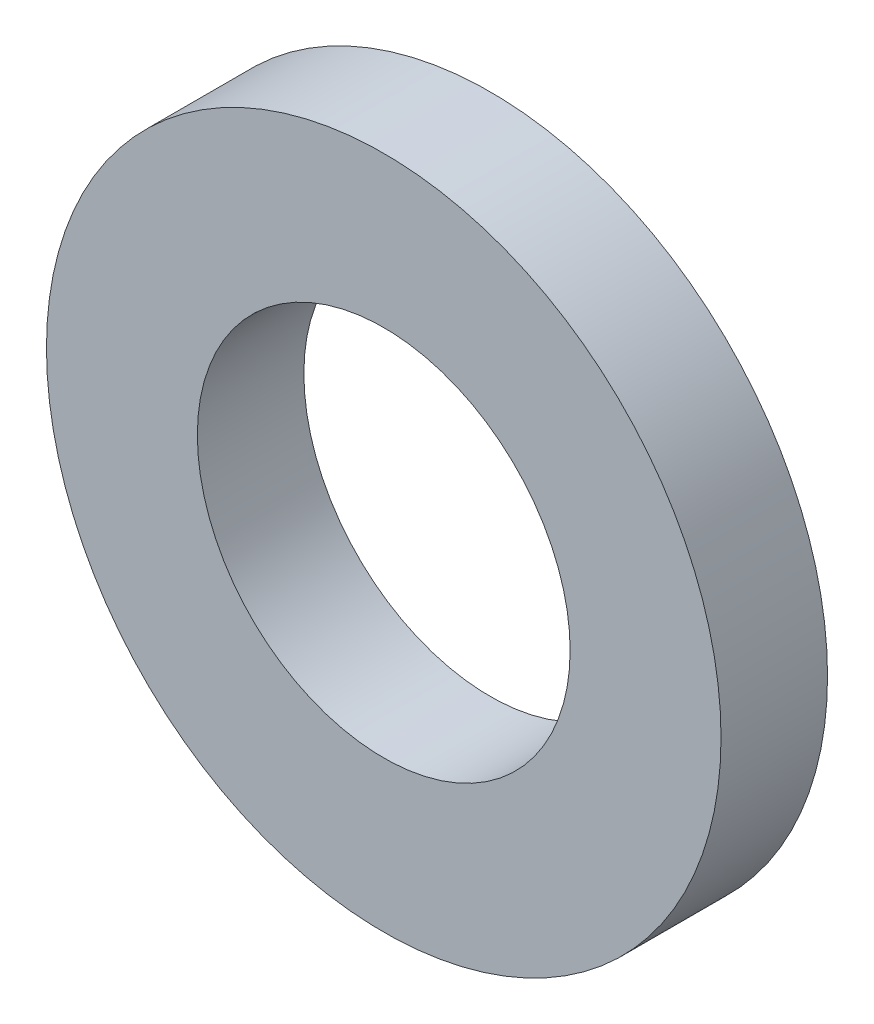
ISO-10303-21;
HEADER;
FILE_DESCRIPTION(('STEP AP214'),'2;1');
FILE_NAME('part.step','',(''),(''),'','','');
FILE_SCHEMA(('AUTOMOTIVE_DESIGN { 1 0 10303 214 1 1 1 1 }'));
ENDSEC;
DATA;
#1=APPLICATION_CONTEXT('core data for automotive mechanical design processes');
#2=APPLICATION_PROTOCOL_DEFINITION('international standard','automotive_design',2000,#1);
#3=PRODUCT_CONTEXT('',#1,'mechanical');
#4=PRODUCT('Part','Part','',(#3));
#5=PRODUCT_RELATED_PRODUCT_CATEGORY('part','',(#4));
#6=PRODUCT_DEFINITION_FORMATION('','',#4);
#7=PRODUCT_DEFINITION_CONTEXT('part definition',#1,'design');
#8=PRODUCT_DEFINITION('design','',#6,#7);
#9=PRODUCT_DEFINITION_SHAPE('','',#8);
#10=(LENGTH_UNIT() NAMED_UNIT(*) SI_UNIT(.MILLI.,.METRE.));
#11=(NAMED_UNIT(*) PLANE_ANGLE_UNIT() SI_UNIT($,.RADIAN.));
#12=(NAMED_UNIT(*) SI_UNIT($,.STERADIAN.) SOLID_ANGLE_UNIT());
#13=UNCERTAINTY_MEASURE_WITH_UNIT(LENGTH_MEASURE(1.E-05),#10,'distance_accuracy_value','');
#14=(GEOMETRIC_REPRESENTATION_CONTEXT(3) GLOBAL_UNCERTAINTY_ASSIGNED_CONTEXT((#13)) GLOBAL_UNIT_ASSIGNED_CONTEXT((#10,
#11,#12)) REPRESENTATION_CONTEXT('',''));
#15=CARTESIAN_POINT('',(0.,0.,0.));
#16=DIRECTION('',(0.,0.,1.));
#17=DIRECTION('',(1.,0.,0.));
#18=AXIS2_PLACEMENT_3D('',#15,#16,#17);
#19=CARTESIAN_POINT('',(0.,0.,3.));
#20=DIRECTION('',(0.,0.,1.));
#21=DIRECTION('',(1.,0.,0.));
#22=AXIS2_PLACEMENT_3D('',#19,#20,#21);
#23=PLANE('',#22);
#24=CARTESIAN_POINT('',(0.,0.,3.));
#25=DIRECTION('',(0.,0.,1.));
#26=DIRECTION('',(1.,0.,0.));
#27=AXIS2_PLACEMENT_3D('',#24,#25,#26);
#28=CIRCLE('',#27,9.5);
#29=CARTESIAN_POINT('',(9.5,0.,3.));
#30=VERTEX_POINT('',#29);
#31=EDGE_CURVE('E8',#30,#30,#28,.T.);
#32=ORIENTED_EDGE('',*,*,#31,.T.);
#33=EDGE_LOOP('',(#32));
#34=FACE_BOUND('',#33,.T.);
#35=CARTESIAN_POINT('',(0.,0.,3.));
#36=DIRECTION('',(0.,0.,1.));
#37=DIRECTION('',(1.,0.,0.));
#38=AXIS2_PLACEMENT_3D('',#35,#36,#37);
#39=CIRCLE('',#38,5.25);
#40=CARTESIAN_POINT('',(5.25,0.,3.));
#41=VERTEX_POINT('',#40);
#42=EDGE_CURVE('E23',#41,#41,#39,.T.);
#43=ORIENTED_EDGE('',*,*,#42,.F.);
#44=EDGE_LOOP('',(#43));
#45=FACE_BOUND('',#44,.T.);
#46=ADVANCED_FACE('F12',(#34,#45),#23,.T.);
#47=CARTESIAN_POINT('',(0.,0.,0.));
#48=DIRECTION('',(0.,0.,1.));
#49=DIRECTION('',(1.,0.,0.));
#50=AXIS2_PLACEMENT_3D('',#47,#48,#49);
#51=PLANE('',#50);
#52=CARTESIAN_POINT('',(0.,0.,0.));
#53=DIRECTION('',(0.,0.,1.));
#54=DIRECTION('',(1.,0.,0.));
#55=AXIS2_PLACEMENT_3D('',#52,#53,#54);
#56=CIRCLE('',#55,9.5);
#57=CARTESIAN_POINT('',(9.5,0.,0.));
#58=VERTEX_POINT('',#57);
#59=EDGE_CURVE('E19',#58,#58,#56,.T.);
#60=ORIENTED_EDGE('',*,*,#59,.F.);
#61=EDGE_LOOP('',(#60));
#62=FACE_BOUND('',#61,.T.);
#63=CARTESIAN_POINT('',(0.,0.,0.));
#64=DIRECTION('',(0.,0.,1.));
#65=DIRECTION('',(1.,0.,0.));
#66=AXIS2_PLACEMENT_3D('',#63,#64,#65);
#67=CIRCLE('',#66,5.25);
#68=CARTESIAN_POINT('',(5.25,0.,0.));
#69=VERTEX_POINT('',#68);
#70=EDGE_CURVE('E27',#69,#69,#67,.T.);
#71=ORIENTED_EDGE('',*,*,#70,.T.);
#72=EDGE_LOOP('',(#71));
#73=FACE_BOUND('',#72,.T.);
#74=ADVANCED_FACE('F33',(#62,#73),#51,.F.);
#75=CARTESIAN_POINT('',(0.,0.,3.));
#76=DIRECTION('',(0.,0.,-1.));
#77=DIRECTION('',(-1.,0.,0.));
#78=AXIS2_PLACEMENT_3D('',#75,#76,#77);
#79=CYLINDRICAL_SURFACE('',#78,9.5);
#80=ORIENTED_EDGE('',*,*,#31,.F.);
#81=EDGE_LOOP('',(#80));
#82=FACE_BOUND('',#81,.T.);
#83=ORIENTED_EDGE('',*,*,#59,.T.);
#84=EDGE_LOOP('',(#83));
#85=FACE_BOUND('',#84,.T.);
#86=ADVANCED_FACE('F14',(#82,#85),#79,.T.);
#87=CARTESIAN_POINT('',(0.,0.,3.));
#88=DIRECTION('',(0.,0.,-1.));
#89=DIRECTION('',(-1.,0.,0.));
#90=AXIS2_PLACEMENT_3D('',#87,#88,#89);
#91=CYLINDRICAL_SURFACE('',#90,5.25);
#92=ORIENTED_EDGE('',*,*,#42,.T.);
#93=EDGE_LOOP('',(#92));
#94=FACE_BOUND('',#93,.T.);
#95=ORIENTED_EDGE('',*,*,#70,.F.);
#96=EDGE_LOOP('',(#95));
#97=FACE_BOUND('',#96,.T.);
#98=ADVANCED_FACE('F35',(#94,#97),#91,.F.);
#99=CLOSED_SHELL('',(#46,#74,#86,#98));
#100=MANIFOLD_SOLID_BREP('B1',#99);
#101=ADVANCED_BREP_SHAPE_REPRESENTATION('',(#18,#100),#14);
#102=SHAPE_DEFINITION_REPRESENTATION(#9,#101);
ENDSEC;
END-ISO-10303-21;
